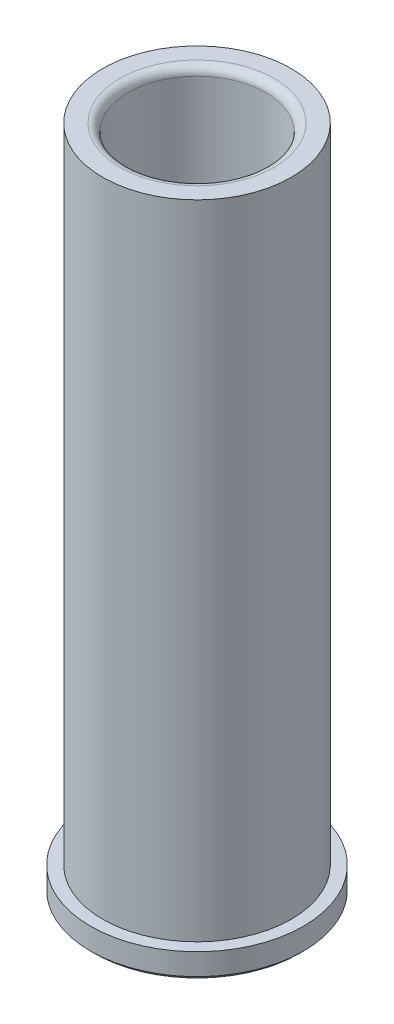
from build123d import *

# Parameters (mm, degrees)
FILLET1_R = 1.524


with BuildPart() as part:
    # Sketch1 → Revolve1 (revolve)
    with BuildSketch(Plane.XY, mode=Mode.PRIVATE) as revolve1_sk:
        Polygon((-18.9484, 0), (-19.7104, 0.762), (-19.7104, 4.7625), (-17.46885, 4.7625), (-17.46885, 123.825), (-12.7635, 123.825), (-12.7635, 0.762), (-13.5255, 0), align=None)
    revolve(revolve1_sk.sketch.rotate(Axis((0, -1000, 0), (0, 1, 0)), 180), axis=Axis((0, -1000, 0), (0, 1, 0)))

    # Fillet1
    fillet1_edges = [part.edges().sort_by_distance(p)[0] for p in [
        (-12.7635, 123.825, 0),
    ]]
    fillet(fillet1_edges, radius=FILLET1_R)


solid = part.part
